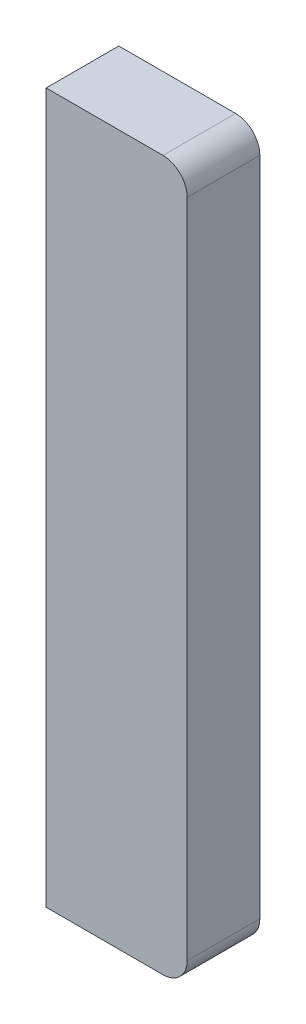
from build123d import *

# Parameters (mm, degrees)
BOSS_EXTRU_1_DEPTH = 3


with BuildPart() as part:
    # Esquisse1 → Boss.-Extru.1 (new body)
    with BuildSketch(Plane.XY):
        with BuildLine():
            Line((10, -42.665103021), (10, -13.363539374))
            Line((10, -13.363539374), (14.822446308, -13.363539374))
            ThreePointArc((14.822446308, -13.363539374), (15.529553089, -13.656432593), (15.822446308, -14.363539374))
            Line((15.822446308, -14.363539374), (15.822446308, -41.665103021))
            ThreePointArc((15.822446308, -41.665103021), (15.529553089, -42.372209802), (14.822446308, -42.665103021))
            Line((14.822446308, -42.665103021), (10, -42.665103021))
        make_face()
    extrude(amount=BOSS_EXTRU_1_DEPTH)


solid = part.part
